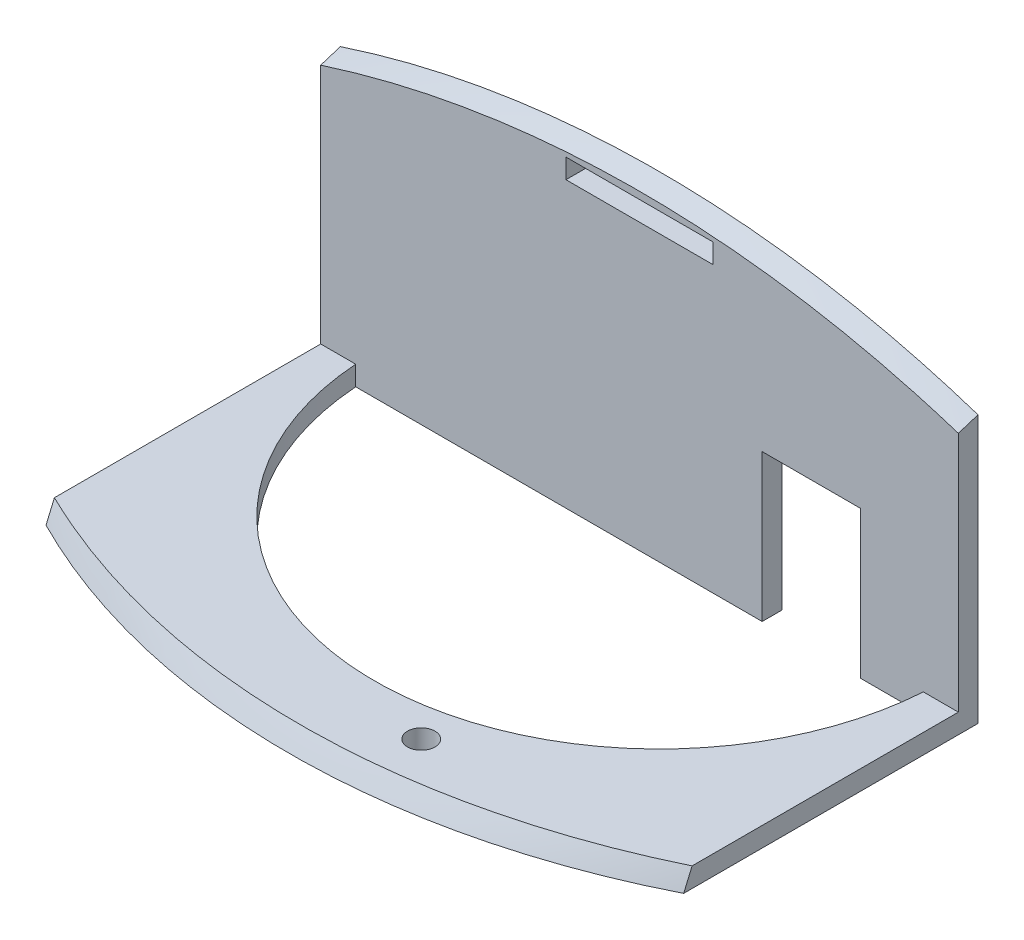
ISO-10303-21;
HEADER;
FILE_DESCRIPTION(('STEP AP214'),'2;1');
FILE_NAME('part.step','',(''),(''),'','','');
FILE_SCHEMA(('AUTOMOTIVE_DESIGN { 1 0 10303 214 1 1 1 1 }'));
ENDSEC;
DATA;
#1=APPLICATION_CONTEXT('core data for automotive mechanical design processes');
#2=APPLICATION_PROTOCOL_DEFINITION('international standard','automotive_design',2000,#1);
#3=PRODUCT_CONTEXT('',#1,'mechanical');
#4=PRODUCT('Part','Part','',(#3));
#5=PRODUCT_RELATED_PRODUCT_CATEGORY('part','',(#4));
#6=PRODUCT_DEFINITION_FORMATION('','',#4);
#7=PRODUCT_DEFINITION_CONTEXT('part definition',#1,'design');
#8=PRODUCT_DEFINITION('design','',#6,#7);
#9=PRODUCT_DEFINITION_SHAPE('','',#8);
#10=(LENGTH_UNIT() NAMED_UNIT(*) SI_UNIT(.MILLI.,.METRE.));
#11=(NAMED_UNIT(*) PLANE_ANGLE_UNIT() SI_UNIT($,.RADIAN.));
#12=(NAMED_UNIT(*) SI_UNIT($,.STERADIAN.) SOLID_ANGLE_UNIT());
#13=UNCERTAINTY_MEASURE_WITH_UNIT(LENGTH_MEASURE(1.E-05),#10,'distance_accuracy_value','');
#14=(GEOMETRIC_REPRESENTATION_CONTEXT(3) GLOBAL_UNCERTAINTY_ASSIGNED_CONTEXT((#13)) GLOBAL_UNIT_ASSIGNED_CONTEXT((#10,
#11,#12)) REPRESENTATION_CONTEXT('',''));
#15=CARTESIAN_POINT('',(0.,0.,0.));
#16=DIRECTION('',(0.,0.,1.));
#17=DIRECTION('',(1.,0.,0.));
#18=AXIS2_PLACEMENT_3D('',#15,#16,#17);
#19=CARTESIAN_POINT('',(32.5,0.,25.));
#20=DIRECTION('',(1.,0.,0.));
#21=DIRECTION('',(0.,0.,-1.));
#22=AXIS2_PLACEMENT_3D('',#19,#20,#21);
#23=PLANE('',#22);
#24=DIRECTION('',(0.,0.,1.));
#25=VECTOR('',#24,1.);
#26=CARTESIAN_POINT('',(32.5,2.,0.999999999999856));
#27=LINE('',#26,#25);
#28=CARTESIAN_POINT('',(32.5,2.,-23.));
#29=VERTEX_POINT('',#28);
#30=CARTESIAN_POINT('',(32.5,2.,4.14318462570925));
#31=VERTEX_POINT('',#30);
#32=EDGE_CURVE('E366',#29,#31,#27,.T.);
#33=ORIENTED_EDGE('',*,*,#32,.T.);
#34=CARTESIAN_POINT('',(32.5,2.,4.14318462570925));
#35=CARTESIAN_POINT('',(32.5,1.3401544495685,4.44437402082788));
#36=CARTESIAN_POINT('',(32.5,0.673243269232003,4.73008389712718));
#37=CARTESIAN_POINT('',(32.5,0.,4.99999999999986));
#38=(BOUNDED_CURVE() B_SPLINE_CURVE(3,(#34,#35,#36,#37),.UNSPECIFIED.,.F.,
.F.) B_SPLINE_CURVE_WITH_KNOTS((4,4),(-0.0518803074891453,0.),
.UNSPECIFIED.) CURVE() GEOMETRIC_REPRESENTATION_ITEM() RATIONAL_B_SPLINE_CURVE((1.,1.,1.,1.)) REPRESENTATION_ITEM(''));
#39=CARTESIAN_POINT('',(32.5,0.,4.99999999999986));
#40=VERTEX_POINT('',#39);
#41=EDGE_CURVE('E10',#31,#40,#38,.T.);
#42=ORIENTED_EDGE('',*,*,#41,.T.);
#43=DIRECTION('',(0.,0.,-1.));
#44=VECTOR('',#43,1.);
#45=CARTESIAN_POINT('',(32.5,0.,25.));
#46=LINE('',#45,#44);
#47=CARTESIAN_POINT('',(32.5,0.,-25.));
#48=VERTEX_POINT('',#47);
#49=EDGE_CURVE('E435',#40,#48,#46,.T.);
#50=ORIENTED_EDGE('',*,*,#49,.T.);
#51=DIRECTION('',(0.,1.,0.));
#52=VECTOR('',#51,1.);
#53=CARTESIAN_POINT('',(32.5,0.,-25.));
#54=LINE('',#53,#52);
#55=CARTESIAN_POINT('',(32.5,27.25,-25.));
#56=VERTEX_POINT('',#55);
#57=EDGE_CURVE('E190',#48,#56,#54,.T.);
#58=ORIENTED_EDGE('',*,*,#57,.T.);
#59=CARTESIAN_POINT('',(32.5,27.25,-25.));
#60=CARTESIAN_POINT('',(32.5,27.0530904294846,-24.328650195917));
#61=CARTESIAN_POINT('',(32.5,26.8409898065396,-23.6617560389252));
#62=CARTESIAN_POINT('',(32.5,26.6139151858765,-23.));
#63=(BOUNDED_CURVE() B_SPLINE_CURVE(3,(#59,#60,#61,#62),.UNSPECIFIED.,.F.,
.F.) B_SPLINE_CURVE_WITH_KNOTS((4,4),(-1.,-0.949958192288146),
.UNSPECIFIED.) CURVE() GEOMETRIC_REPRESENTATION_ITEM() RATIONAL_B_SPLINE_CURVE((1.,1.,1.,1.)) REPRESENTATION_ITEM(''));
#64=CARTESIAN_POINT('',(32.5,26.6139151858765,-23.));
#65=VERTEX_POINT('',#64);
#66=EDGE_CURVE('E29',#56,#65,#63,.T.);
#67=ORIENTED_EDGE('',*,*,#66,.T.);
#68=DIRECTION('',(0.,-1.,0.));
#69=VECTOR('',#68,1.);
#70=CARTESIAN_POINT('',(32.5,17.587856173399,-23.));
#71=LINE('',#70,#69);
#72=EDGE_CURVE('E397',#65,#29,#71,.T.);
#73=ORIENTED_EDGE('',*,*,#72,.T.);
#74=EDGE_LOOP('',(#33,#42,#50,#58,#67,#73));
#75=FACE_BOUND('',#74,.T.);
#76=ADVANCED_FACE('F15',(#75),#23,.T.);
#77=CARTESIAN_POINT('',(-32.5,0.,4.99999999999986));
#78=CARTESIAN_POINT('',(-32.5,0.673243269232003,4.73008389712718));
#79=CARTESIAN_POINT('',(-32.5,1.3401544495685,4.44437402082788));
#80=CARTESIAN_POINT('',(-32.5,2.,4.14318462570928));
#81=CARTESIAN_POINT('',(-26.7685755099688,0.,7.89825468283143));
#82=CARTESIAN_POINT('',(-26.7642978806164,0.707415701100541,7.57821779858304));
#83=CARTESIAN_POINT('',(-26.7600209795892,1.40849520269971,7.24239969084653));
#84=CARTESIAN_POINT('',(-26.7557426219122,2.10251729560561,6.89107696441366));
#85=CARTESIAN_POINT('',(-14.5275749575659,0.,12.1483336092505));
#86=CARTESIAN_POINT('',(-14.5220751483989,0.75623346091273,11.756695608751));
#87=CARTESIAN_POINT('',(-14.5165540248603,1.5062247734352,11.3489767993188));
#88=CARTESIAN_POINT('',(-14.5110215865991,2.2492385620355,10.9254972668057));
#89=CARTESIAN_POINT('',(8.10648972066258,0.,13.6757710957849));
#90=CARTESIAN_POINT('',(8.10312872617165,0.773319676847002,13.2590727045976));
#91=CARTESIAN_POINT('',(8.09974602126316,1.54047160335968,12.8260560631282));
#92=CARTESIAN_POINT('',(8.09635943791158,2.30068829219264,12.3771431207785));
#93=CARTESIAN_POINT('',(23.9028632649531,0.,9.3473820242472));
#94=CARTESIAN_POINT('',(23.8964468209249,0.724501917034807,9.00228474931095));
#95=CARTESIAN_POINT('',(23.8900420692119,1.44265722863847,8.64143929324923));
#96=CARTESIAN_POINT('',(23.8836139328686,2.15377594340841,8.26502313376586));
#97=CARTESIAN_POINT('',(32.5,0.,4.99999999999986));
#98=CARTESIAN_POINT('',(32.5,0.673243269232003,4.73008389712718));
#99=CARTESIAN_POINT('',(32.5,1.3401544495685,4.44437402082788));
#100=CARTESIAN_POINT('',(32.5,2.,4.14318462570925));
#101=(BOUNDED_SURFACE() B_SPLINE_SURFACE(3,3,((#77,#78,#79,#80),(#81,#82,#83,#84),(#85,#86,#87,
#88),(#89,#90,#91,#92),(#93,#94,#95,#96),(#97,#98,#99,#100)),.UNSPECIFIED.,.F.,.F.,
.F.) B_SPLINE_SURFACE_WITH_KNOTS((4,1,1,4),(4,4),(0.,0.285714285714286,0.571428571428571,1.),
(0.,0.0518803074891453),
.UNSPECIFIED.) GEOMETRIC_REPRESENTATION_ITEM() RATIONAL_B_SPLINE_SURFACE(((1.,1.,1.,1.),(1.,1.,
1.,1.),(1.,1.,1.,1.),(1.,1.,1.,1.),(1.,1.,1.,1.),(1.,1.,1.,1.))) REPRESENTATION_ITEM('') SURFACE());
#102=CARTESIAN_POINT('',(32.5,2.,4.14318462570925));
#103=CARTESIAN_POINT('',(31.3821770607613,1.99999276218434,4.68703734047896));
#104=CARTESIAN_POINT('',(30.2507061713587,1.99991978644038,5.20281299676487));
#105=CARTESIAN_POINT('',(27.9210890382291,1.99972160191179,6.19522493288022));
#106=CARTESIAN_POINT('',(26.7220247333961,1.99959456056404,6.66970721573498));
#107=CARTESIAN_POINT('',(24.2579070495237,1.99937675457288,7.5718377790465));
#108=CARTESIAN_POINT('',(22.9920235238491,1.99928744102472,7.99721985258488));
#109=CARTESIAN_POINT('',(20.3956616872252,1.99919560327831,8.79306237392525));
#110=CARTESIAN_POINT('',(19.06445516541,1.99919615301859,9.16114580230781));
#111=CARTESIAN_POINT('',(16.339441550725,1.999302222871,9.83391129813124));
#112=CARTESIAN_POINT('',(14.9450166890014,1.99941119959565,10.1361059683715));
#113=CARTESIAN_POINT('',(12.825549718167,1.99962995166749,10.532007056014));
#114=CARTESIAN_POINT('',(12.105944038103,1.99971338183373,10.6554872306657));
#115=CARTESIAN_POINT('',(10.6522076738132,1.99989041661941,10.882888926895));
#116=CARTESIAN_POINT('',(9.91802459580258,1.99998415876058,10.9864780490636));
#117=CARTESIAN_POINT('',(8.43567504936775,2.00016977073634,11.172905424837));
#118=CARTESIAN_POINT('',(7.68746589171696,2.00026159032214,11.2554036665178));
#119=CARTESIAN_POINT('',(6.1776271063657,2.00042655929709,11.3984350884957));
#120=CARTESIAN_POINT('',(5.41596445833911,2.00049940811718,11.4586203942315));
#121=CARTESIAN_POINT('',(3.87986241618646,2.00060711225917,11.55579873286));
#122=CARTESIAN_POINT('',(3.10540051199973,2.00064139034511,11.5924359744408));
#123=CARTESIAN_POINT('',(1.54443652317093,2.00064158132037,11.6415575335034));
#124=CARTESIAN_POINT('',(0.757923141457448,2.00060649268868,11.6536828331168));
#125=CARTESIAN_POINT('',(-0.805741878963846,2.00046057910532,11.6528007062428));
#126=CARTESIAN_POINT('',(-1.58289370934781,2.00035065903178,11.6400902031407));
#127=CARTESIAN_POINT('',(-3.12629964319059,2.00010388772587,11.5905084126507));
#128=CARTESIAN_POINT('',(-3.89256393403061,1.99996740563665,11.5539537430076));
#129=CARTESIAN_POINT('',(-5.41345426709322,1.99968474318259,11.4577039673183));
#130=CARTESIAN_POINT('',(-6.16810010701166,1.99953871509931,11.3983215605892));
#131=CARTESIAN_POINT('',(-7.66507103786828,1.99925632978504,11.2574225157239));
#132=CARTESIAN_POINT('',(-8.40742522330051,1.99911986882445,11.1762146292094));
#133=CARTESIAN_POINT('',(-9.87919870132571,1.99886970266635,10.9926541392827));
#134=CARTESIAN_POINT('',(-10.6086559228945,1.99875571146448,10.8906062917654));
#135=CARTESIAN_POINT('',(-12.0540422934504,1.99855963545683,10.6663630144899));
#136=CARTESIAN_POINT('',(-12.7700183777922,1.99847712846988,10.5444679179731));
#137=CARTESIAN_POINT('',(-14.8817247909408,1.99828764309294,10.1527689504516));
#138=CARTESIAN_POINT('',(-16.2720385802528,1.99823285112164,9.85308051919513));
#139=CARTESIAN_POINT('',(-18.9930267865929,1.99828013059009,9.18418783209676));
#140=CARTESIAN_POINT('',(-20.3242618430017,1.99837770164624,8.81725011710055));
#141=CARTESIAN_POINT('',(-22.924817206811,1.99868101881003,8.02217853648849));
#142=CARTESIAN_POINT('',(-24.194797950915,1.99888343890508,7.59620565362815));
#143=CARTESIAN_POINT('',(-26.6710899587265,1.99931092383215,6.69096875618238));
#144=CARTESIAN_POINT('',(-27.8781548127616,1.99953509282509,6.21376460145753));
#145=CARTESIAN_POINT('',(-30.2275376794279,1.99987354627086,5.21361273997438));
#146=CARTESIAN_POINT('',(-31.3706903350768,1.99999112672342,4.69262487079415));
#147=CARTESIAN_POINT('',(-32.5,2.,4.14318462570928));
#148=B_SPLINE_CURVE_WITH_KNOTS('',3,(#102,#103,#104,#105,#106,#107,#108,#109,#110,#111,#112,
#113,#114,#115,#116,#117,#118,#119,#120,#121,#122,#123,#124,#125,#126,#127,#128,#129,#130,#131,
#132,#133,#134,#135,#136,#137,#138,#139,#140,#141,#142,#143,#144,#145,#146,#147),.UNSPECIFIED.,
.F.,.F.,(4,2,2,2,2,2,2,2,2,2,2,2,2,2,2,2,2,2,2,2,2,2,4),(0.,3.72890680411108,7.59577077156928,
11.6001788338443,15.7415927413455,20.0194044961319,22.2095123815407,24.4335270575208,
26.6914086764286,28.9831434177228,31.3087373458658,33.668153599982,35.9995344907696,
38.3005713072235,40.5711507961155,42.8111619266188,45.0205010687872,47.199076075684,
51.4632265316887,55.6037880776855,59.6203888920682,63.5125519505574,67.2797891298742),.UNSPECIFIED.);
#149=CARTESIAN_POINT('',(-32.5,1.99999999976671,4.14318462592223));
#150=VERTEX_POINT('',#149);
#151=EDGE_CURVE('E353',#31,#150,#148,.T.);
#152=CARTESIAN_POINT('',(-32.5,0.,4.99999999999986));
#153=CARTESIAN_POINT('',(-32.5,0.673243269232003,4.73008389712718));
#154=CARTESIAN_POINT('',(-32.5,1.3401544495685,4.44437402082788));
#155=CARTESIAN_POINT('',(-32.5,2.,4.14318462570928));
#156=(BOUNDED_CURVE() B_SPLINE_CURVE(3,(#152,#153,#154,#155),.UNSPECIFIED.,.F.,
.F.) B_SPLINE_CURVE_WITH_KNOTS((4,4),(0.,0.0518803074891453),
.UNSPECIFIED.) CURVE() GEOMETRIC_REPRESENTATION_ITEM() RATIONAL_B_SPLINE_CURVE((1.,1.,1.,1.)) REPRESENTATION_ITEM(''));
#157=CARTESIAN_POINT('',(-32.5,0.,4.99999999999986));
#158=VERTEX_POINT('',#157);
#159=EDGE_CURVE('E375',#158,#150,#156,.T.);
#160=CARTESIAN_POINT('',(32.5,0.,4.99999999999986));
#161=CARTESIAN_POINT('',(23.9028632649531,0.,9.3473820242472));
#162=CARTESIAN_POINT('',(8.10648972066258,0.,13.6757710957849));
#163=CARTESIAN_POINT('',(-14.5275749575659,0.,12.1483336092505));
#164=CARTESIAN_POINT('',(-26.7685755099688,0.,7.89825468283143));
#165=CARTESIAN_POINT('',(-32.5,0.,4.99999999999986));
#166=(BOUNDED_CURVE() B_SPLINE_CURVE(3,(#160,#161,#162,#163,#164,#165),.UNSPECIFIED.,.F.,
.F.) B_SPLINE_CURVE_WITH_KNOTS((4,1,1,4),(-1.,-0.571428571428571,-0.285714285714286,0.),
.UNSPECIFIED.) CURVE() GEOMETRIC_REPRESENTATION_ITEM() RATIONAL_B_SPLINE_CURVE((1.,1.,1.,1.,1.,1.)) REPRESENTATION_ITEM(''));
#167=EDGE_CURVE('E394',#40,#158,#166,.T.);
#168=ORIENTED_EDGE('',*,*,#151,.T.);
#169=ORIENTED_EDGE('',*,*,#159,.F.);
#170=ORIENTED_EDGE('',*,*,#167,.F.);
#171=ORIENTED_EDGE('',*,*,#41,.F.);
#172=EDGE_LOOP('',(#168,#169,#170,#171));
#173=FACE_BOUND('',#172,.T.);
#174=ADVANCED_FACE('F323',(#173),#101,.T.);
#175=CARTESIAN_POINT('',(-32.5,26.6139151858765,-23.));
#176=CARTESIAN_POINT('',(-32.5,26.8409898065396,-23.6617560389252));
#177=CARTESIAN_POINT('',(-32.5,27.0530904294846,-24.328650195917));
#178=CARTESIAN_POINT('',(-32.5,27.25,-25.));
#179=CARTESIAN_POINT('',(-20.5671959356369,30.3682161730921,-22.7099321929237));
#180=CARTESIAN_POINT('',(-20.5589185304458,30.6612554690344,-23.4685100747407));
#181=CARTESIAN_POINT('',(-20.5506917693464,30.9392372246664,-24.2319609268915));
#182=CARTESIAN_POINT('',(-20.5424396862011,31.2020696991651,-25.));
#183=CARTESIAN_POINT('',(1.65970779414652,33.2738870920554,-22.4902805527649));
#184=CARTESIAN_POINT('',(1.65763986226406,33.6167364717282,-23.3225516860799));
#185=CARTESIAN_POINT('',(1.65558040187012,33.9444504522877,-24.1594439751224));
#186=CARTESIAN_POINT('',(1.6535173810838,34.2567251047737,-25.));
#187=CARTESIAN_POINT('',(23.5503969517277,29.4296409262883,-22.7824491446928));
#188=CARTESIAN_POINT('',(23.5441867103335,29.7061583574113,-23.5167233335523));
#189=CARTESIAN_POINT('',(23.5380188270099,29.967700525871,-24.2561332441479));
#190=CARTESIAN_POINT('',(23.531829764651,30.2140522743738,-25.));
#191=CARTESIAN_POINT('',(32.5,26.6139151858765,-23.));
#192=CARTESIAN_POINT('',(32.5,26.8409898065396,-23.6617560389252));
#193=CARTESIAN_POINT('',(32.5,27.0530904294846,-24.328650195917));
#194=CARTESIAN_POINT('',(32.5,27.25,-25.));
#195=(BOUNDED_SURFACE() B_SPLINE_SURFACE(3,3,((#175,#176,#177,#178),(#179,#180,#181,#182),(#183,
#184,#185,#186),(#187,#188,#189,#190),(#191,#192,#193,#194)),.UNSPECIFIED.,.F.,.F.,
.F.) B_SPLINE_SURFACE_WITH_KNOTS((4,1,4),(4,4),(0.,0.571428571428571,1.),(0.949958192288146,1.),
.UNSPECIFIED.) GEOMETRIC_REPRESENTATION_ITEM() RATIONAL_B_SPLINE_SURFACE(((1.,1.,1.,1.),(1.,1.,
1.,1.),(1.,1.,1.,1.),(1.,1.,1.,1.),(1.,1.,1.,1.))) REPRESENTATION_ITEM('') SURFACE());
#196=CARTESIAN_POINT('',(-32.5,26.6139151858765,-23.));
#197=CARTESIAN_POINT('',(-31.370216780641,26.9787964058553,-23.0000143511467));
#198=CARTESIAN_POINT('',(-30.2342610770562,27.3245606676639,-23.000215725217));
#199=CARTESIAN_POINT('',(-27.8990585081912,27.9925354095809,-23.0008108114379));
#200=CARTESIAN_POINT('',(-26.6992954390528,28.3129422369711,-23.0012129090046));
#201=CARTESIAN_POINT('',(-24.2366077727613,28.9243980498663,-23.0020067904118));
#202=CARTESIAN_POINT('',(-22.9732129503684,29.2135539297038,-23.0023973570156));
#203=CARTESIAN_POINT('',(-20.3837484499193,29.7564401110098,-23.0030241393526));
#204=CARTESIAN_POINT('',(-19.057263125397,30.008188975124,-23.0032532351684));
#205=CARTESIAN_POINT('',(-16.3425081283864,30.4699274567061,-23.0034645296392));
#206=CARTESIAN_POINT('',(-14.9538863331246,30.6778482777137,-23.0034365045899));
#207=CARTESIAN_POINT('',(-12.1162017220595,31.0453404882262,-23.0031183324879));
#208=CARTESIAN_POINT('',(-10.6668595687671,31.202757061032,-23.0028181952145));
#209=CARTESIAN_POINT('',(-7.70958334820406,31.4624060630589,-23.0020493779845));
#210=CARTESIAN_POINT('',(-6.2014523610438,31.5623993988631,-23.0015749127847));
#211=CARTESIAN_POINT('',(-3.12900986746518,31.7001151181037,-23.0006398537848));
#212=CARTESIAN_POINT('',(-1.56459391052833,31.73551548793,-23.000180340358));
#213=CARTESIAN_POINT('',(1.57889992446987,31.7367677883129,-22.9997523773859));
#214=CARTESIAN_POINT('',(3.15797817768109,31.7019665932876,-22.9997885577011));
#215=CARTESIAN_POINT('',(6.25547089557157,31.5635485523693,-23.0001263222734));
#216=CARTESIAN_POINT('',(7.77399983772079,31.4624846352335,-23.0004181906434));
#217=CARTESIAN_POINT('',(10.7477698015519,31.1996693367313,-23.0009715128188));
#218=CARTESIAN_POINT('',(12.2032275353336,31.0403640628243,-23.0012337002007));
#219=CARTESIAN_POINT('',(15.0488718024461,30.6688721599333,-23.0016008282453));
#220=CARTESIAN_POINT('',(16.4393641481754,30.459024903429,-23.0017115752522));
#221=CARTESIAN_POINT('',(19.1536623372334,29.993913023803,-23.0017429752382));
#222=CARTESIAN_POINT('',(20.4778511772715,29.7408812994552,-23.001671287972));
#223=CARTESIAN_POINT('',(23.0586357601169,29.1965227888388,-23.0013885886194));
#224=CARTESIAN_POINT('',(24.3156803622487,28.907322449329,-23.0011837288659));
#225=CARTESIAN_POINT('',(26.7617199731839,28.2974008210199,-23.0007370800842));
#226=CARTESIAN_POINT('',(27.9512190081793,27.9786997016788,-23.0004973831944));
#227=CARTESIAN_POINT('',(30.2621085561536,27.3162063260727,-23.0001365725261));
#228=CARTESIAN_POINT('',(31.3840480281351,26.9743279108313,-23.0000103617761));
#229=CARTESIAN_POINT('',(32.5,26.6139151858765,-23.));
#230=B_SPLINE_CURVE_WITH_KNOTS('',3,(#196,#197,#198,#199,#200,#201,#202,#203,#204,#205,#206,
#207,#208,#209,#210,#211,#212,#213,#214,#215,#216,#217,#218,#219,#220,#221,#222,#223,#224,#225,
#226,#227,#228,#229),.UNSPECIFIED.,.F.,.F.,(4,2,2,2,2,2,2,2,2,2,2,2,2,2,2,2,4),(0.,
3.56156413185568,7.28622214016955,11.1735366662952,15.2230423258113,19.4342421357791,
23.8066022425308,28.3395467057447,33.0324549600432,37.7692253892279,42.3334493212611,
46.7246301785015,50.9422250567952,54.9856852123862,58.8544758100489,62.5480902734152,
66.0660618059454),.UNSPECIFIED.);
#231=CARTESIAN_POINT('',(-32.5,26.6139151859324,-23.0000000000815));
#232=VERTEX_POINT('',#231);
#233=EDGE_CURVE('E272',#232,#65,#230,.T.);
#234=CARTESIAN_POINT('',(-32.5,27.25,-25.));
#235=CARTESIAN_POINT('',(-20.5424396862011,31.2020696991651,-25.));
#236=CARTESIAN_POINT('',(1.6535173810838,34.2567251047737,-25.));
#237=CARTESIAN_POINT('',(23.531829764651,30.2140522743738,-25.));
#238=CARTESIAN_POINT('',(32.5,27.25,-25.));
#239=(BOUNDED_CURVE() B_SPLINE_CURVE(3,(#234,#235,#236,#237,#238),.UNSPECIFIED.,.F.,
.F.) B_SPLINE_CURVE_WITH_KNOTS((4,1,4),(0.,0.571428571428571,1.),
.UNSPECIFIED.) CURVE() GEOMETRIC_REPRESENTATION_ITEM() RATIONAL_B_SPLINE_CURVE((1.,1.,1.,1.,1.)) REPRESENTATION_ITEM(''));
#240=CARTESIAN_POINT('',(-32.5,27.25,-25.));
#241=VERTEX_POINT('',#240);
#242=EDGE_CURVE('E197',#241,#56,#239,.T.);
#243=CARTESIAN_POINT('',(-32.5,26.6139151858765,-23.));
#244=CARTESIAN_POINT('',(-32.5,26.8409898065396,-23.6617560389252));
#245=CARTESIAN_POINT('',(-32.5,27.0530904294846,-24.328650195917));
#246=CARTESIAN_POINT('',(-32.5,27.25,-25.));
#247=(BOUNDED_CURVE() B_SPLINE_CURVE(3,(#243,#244,#245,#246),.UNSPECIFIED.,.F.,
.F.) B_SPLINE_CURVE_WITH_KNOTS((4,4),(0.949958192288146,1.),
.UNSPECIFIED.) CURVE() GEOMETRIC_REPRESENTATION_ITEM() RATIONAL_B_SPLINE_CURVE((1.,1.,1.,1.)) REPRESENTATION_ITEM(''));
#248=EDGE_CURVE('E43',#232,#241,#247,.T.);
#249=ORIENTED_EDGE('',*,*,#233,.T.);
#250=ORIENTED_EDGE('',*,*,#66,.F.);
#251=ORIENTED_EDGE('',*,*,#242,.F.);
#252=ORIENTED_EDGE('',*,*,#248,.F.);
#253=EDGE_LOOP('',(#249,#250,#251,#252));
#254=FACE_BOUND('',#253,.T.);
#255=ADVANCED_FACE('F17',(#254),#195,.T.);
#256=CARTESIAN_POINT('',(-32.5,0.,-25.));
#257=DIRECTION('',(-1.,0.,0.));
#258=DIRECTION('',(0.,1.,0.));
#259=AXIS2_PLACEMENT_3D('',#256,#257,#258);
#260=PLANE('',#259);
#261=DIRECTION('',(0.,0.,-1.));
#262=VECTOR('',#261,1.);
#263=CARTESIAN_POINT('',(-32.5,2.,-24.));
#264=LINE('',#263,#262);
#265=CARTESIAN_POINT('',(-32.5,2.,-23.));
#266=VERTEX_POINT('',#265);
#267=EDGE_CURVE('E171',#150,#266,#264,.T.);
#268=ORIENTED_EDGE('',*,*,#267,.T.);
#269=DIRECTION('',(0.,1.,0.));
#270=VECTOR('',#269,1.);
#271=CARTESIAN_POINT('',(-32.5,17.587856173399,-23.));
#272=LINE('',#271,#270);
#273=EDGE_CURVE('E166',#266,#232,#272,.T.);
#274=ORIENTED_EDGE('',*,*,#273,.T.);
#275=ORIENTED_EDGE('',*,*,#248,.T.);
#276=DIRECTION('',(0.,1.,0.));
#277=VECTOR('',#276,1.);
#278=CARTESIAN_POINT('',(-32.5,0.,-25.));
#279=LINE('',#278,#277);
#280=CARTESIAN_POINT('',(-32.5,0.,-25.));
#281=VERTEX_POINT('',#280);
#282=EDGE_CURVE('E250',#281,#241,#279,.T.);
#283=ORIENTED_EDGE('',*,*,#282,.F.);
#284=DIRECTION('',(0.,0.,1.));
#285=VECTOR('',#284,1.);
#286=CARTESIAN_POINT('',(-32.5,0.,-25.));
#287=LINE('',#286,#285);
#288=EDGE_CURVE('E263',#281,#158,#287,.T.);
#289=ORIENTED_EDGE('',*,*,#288,.T.);
#290=ORIENTED_EDGE('',*,*,#159,.T.);
#291=EDGE_LOOP('',(#268,#274,#275,#283,#289,#290));
#292=FACE_BOUND('',#291,.T.);
#293=ADVANCED_FACE('F297',(#292),#260,.T.);
#294=CARTESIAN_POINT('',(32.5,35.1757123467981,-23.));
#295=DIRECTION('',(0.,0.,-1.));
#296=DIRECTION('',(-1.,0.,0.));
#297=AXIS2_PLACEMENT_3D('',#294,#295,#296);
#298=PLANE('',#297);
#299=DIRECTION('',(0.,-1.,0.));
#300=VECTOR('',#299,1.);
#301=CARTESIAN_POINT('',(7.5,33.0878561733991,-23.));
#302=LINE('',#301,#300);
#303=CARTESIAN_POINT('',(7.5,31.,-23.));
#304=VERTEX_POINT('',#303);
#305=CARTESIAN_POINT('',(7.5,29.,-23.));
#306=VERTEX_POINT('',#305);
#307=EDGE_CURVE('E209',#304,#306,#302,.T.);
#308=ORIENTED_EDGE('',*,*,#307,.T.);
#309=DIRECTION('',(-1.,0.,0.));
#310=VECTOR('',#309,1.);
#311=CARTESIAN_POINT('',(20.,29.,-23.));
#312=LINE('',#311,#310);
#313=CARTESIAN_POINT('',(-7.49999999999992,29.,-23.));
#314=VERTEX_POINT('',#313);
#315=EDGE_CURVE('E481',#306,#314,#312,.T.);
#316=ORIENTED_EDGE('',*,*,#315,.T.);
#317=DIRECTION('',(0.,1.,0.));
#318=VECTOR('',#317,1.);
#319=CARTESIAN_POINT('',(-7.49999999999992,32.0878561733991,-23.));
#320=LINE('',#319,#318);
#321=CARTESIAN_POINT('',(-7.49999999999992,31.,-23.));
#322=VERTEX_POINT('',#321);
#323=EDGE_CURVE('E207',#314,#322,#320,.T.);
#324=ORIENTED_EDGE('',*,*,#323,.T.);
#325=DIRECTION('',(1.,0.,0.));
#326=VECTOR('',#325,1.);
#327=CARTESIAN_POINT('',(12.5,31.,-23.));
#328=LINE('',#327,#326);
#329=EDGE_CURVE('E218',#322,#304,#328,.T.);
#330=ORIENTED_EDGE('',*,*,#329,.T.);
#331=EDGE_LOOP('',(#308,#316,#324,#330));
#332=FACE_BOUND('',#331,.T.);
#333=DIRECTION('',(0.,-1.,0.));
#334=VECTOR('',#333,1.);
#335=CARTESIAN_POINT('',(22.5,25.0878561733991,-23.));
#336=LINE('',#335,#334);
#337=CARTESIAN_POINT('',(22.5,15.,-23.));
#338=VERTEX_POINT('',#337);
#339=CARTESIAN_POINT('',(22.5,0.,-23.));
#340=VERTEX_POINT('',#339);
#341=EDGE_CURVE('E232',#338,#340,#336,.T.);
#342=ORIENTED_EDGE('',*,*,#341,.T.);
#343=DIRECTION('',(-1.,0.,0.));
#344=VECTOR('',#343,1.);
#345=CARTESIAN_POINT('',(-14.4654761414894,0.,-23.));
#346=LINE('',#345,#344);
#347=CARTESIAN_POINT('',(28.930952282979,0.,-23.));
#348=VERTEX_POINT('',#347);
#349=EDGE_CURVE('E247',#348,#340,#346,.T.);
#350=ORIENTED_EDGE('',*,*,#349,.F.);
#351=DIRECTION('',(0.,-1.,0.));
#352=VECTOR('',#351,1.);
#353=CARTESIAN_POINT('',(28.930952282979,2.,-23.));
#354=LINE('',#353,#352);
#355=CARTESIAN_POINT('',(28.930952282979,2.,-23.));
#356=VERTEX_POINT('',#355);
#357=EDGE_CURVE('E172',#356,#348,#354,.T.);
#358=ORIENTED_EDGE('',*,*,#357,.F.);
#359=DIRECTION('',(-1.,0.,0.));
#360=VECTOR('',#359,1.);
#361=CARTESIAN_POINT('',(32.5,2.,-23.));
#362=LINE('',#361,#360);
#363=EDGE_CURVE('E179',#29,#356,#362,.T.);
#364=ORIENTED_EDGE('',*,*,#363,.F.);
#365=ORIENTED_EDGE('',*,*,#72,.F.);
#366=ORIENTED_EDGE('',*,*,#233,.F.);
#367=ORIENTED_EDGE('',*,*,#273,.F.);
#368=DIRECTION('',(-1.,0.,0.));
#369=VECTOR('',#368,1.);
#370=CARTESIAN_POINT('',(32.5,2.,-23.));
#371=LINE('',#370,#369);
#372=CARTESIAN_POINT('',(-28.9309522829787,2.,-23.));
#373=VERTEX_POINT('',#372);
#374=EDGE_CURVE('E157',#373,#266,#371,.T.);
#375=ORIENTED_EDGE('',*,*,#374,.F.);
#376=DIRECTION('',(0.,-1.,0.));
#377=VECTOR('',#376,1.);
#378=CARTESIAN_POINT('',(-28.9309522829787,2.,-23.));
#379=LINE('',#378,#377);
#380=CARTESIAN_POINT('',(-28.9309522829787,0.,-23.));
#381=VERTEX_POINT('',#380);
#382=EDGE_CURVE('E163',#373,#381,#379,.T.);
#383=ORIENTED_EDGE('',*,*,#382,.T.);
#384=DIRECTION('',(-1.,0.,0.));
#385=VECTOR('',#384,1.);
#386=CARTESIAN_POINT('',(-14.4654761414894,0.,-23.));
#387=LINE('',#386,#385);
#388=CARTESIAN_POINT('',(12.5,0.,-23.));
#389=VERTEX_POINT('',#388);
#390=EDGE_CURVE('E201',#389,#381,#387,.T.);
#391=ORIENTED_EDGE('',*,*,#390,.F.);
#392=DIRECTION('',(0.,1.,0.));
#393=VECTOR('',#392,1.);
#394=CARTESIAN_POINT('',(12.5,17.587856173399,-23.));
#395=LINE('',#394,#393);
#396=CARTESIAN_POINT('',(12.5,15.,-23.));
#397=VERTEX_POINT('',#396);
#398=EDGE_CURVE('E238',#389,#397,#395,.T.);
#399=ORIENTED_EDGE('',*,*,#398,.T.);
#400=DIRECTION('',(1.,0.,0.));
#401=VECTOR('',#400,1.);
#402=CARTESIAN_POINT('',(22.5,15.,-23.));
#403=LINE('',#402,#401);
#404=EDGE_CURVE('E436',#397,#338,#403,.T.);
#405=ORIENTED_EDGE('',*,*,#404,.T.);
#406=EDGE_LOOP('',(#342,#350,#358,#364,#365,#366,#367,#375,#383,#391,#399,#405));
#407=FACE_BOUND('',#406,.T.);
#408=ADVANCED_FACE('F160',(#332,#407),#298,.F.);
#409=CARTESIAN_POINT('',(32.5,2.,-23.));
#410=DIRECTION('',(0.,-1.,0.));
#411=DIRECTION('',(0.,0.,-1.));
#412=AXIS2_PLACEMENT_3D('',#409,#410,#411);
#413=PLANE('',#412);
#414=CARTESIAN_POINT('',(7.5,2.,6.74999999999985));
#415=DIRECTION('',(0.,-1.,0.));
#416=DIRECTION('',(1.,0.,0.));
#417=AXIS2_PLACEMENT_3D('',#414,#415,#416);
#418=CIRCLE('',#417,1.4);
#419=CARTESIAN_POINT('',(8.9,2.,6.74999999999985));
#420=VERTEX_POINT('',#419);
#421=CARTESIAN_POINT('',(6.10000000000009,2.,6.74999999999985));
#422=VERTEX_POINT('',#421);
#423=EDGE_CURVE('E227',#420,#422,#418,.T.);
#424=ORIENTED_EDGE('',*,*,#423,.T.);
#425=CARTESIAN_POINT('',(7.5,2.,6.74999999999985));
#426=DIRECTION('',(0.,-1.,0.));
#427=DIRECTION('',(1.,0.,0.));
#428=AXIS2_PLACEMENT_3D('',#425,#426,#427);
#429=CIRCLE('',#428,1.4);
#430=EDGE_CURVE('E223',#422,#420,#429,.T.);
#431=ORIENTED_EDGE('',*,*,#430,.T.);
#432=EDGE_LOOP('',(#424,#431));
#433=FACE_BOUND('',#432,.T.);
#434=CARTESIAN_POINT('',(0.,2.,-25.));
#435=DIRECTION('',(0.,-1.,0.));
#436=DIRECTION('',(1.,0.,0.));
#437=AXIS2_PLACEMENT_3D('',#434,#435,#436);
#438=CIRCLE('',#437,29.);
#439=EDGE_CURVE('E175',#356,#373,#438,.T.);
#440=ORIENTED_EDGE('',*,*,#439,.T.);
#441=ORIENTED_EDGE('',*,*,#374,.T.);
#442=ORIENTED_EDGE('',*,*,#267,.F.);
#443=ORIENTED_EDGE('',*,*,#151,.F.);
#444=ORIENTED_EDGE('',*,*,#32,.F.);
#445=ORIENTED_EDGE('',*,*,#363,.T.);
#446=EDGE_LOOP('',(#440,#441,#442,#443,#444,#445));
#447=FACE_BOUND('',#446,.T.);
#448=ADVANCED_FACE('F176',(#433,#447),#413,.F.);
#449=CARTESIAN_POINT('',(0.,2.,-25.));
#450=DIRECTION('',(0.,-1.,0.));
#451=DIRECTION('',(1.,0.,0.));
#452=AXIS2_PLACEMENT_3D('',#449,#450,#451);
#453=CYLINDRICAL_SURFACE('',#452,29.);
#454=CARTESIAN_POINT('',(0.,0.,-25.));
#455=DIRECTION('',(0.,1.,0.));
#456=DIRECTION('',(1.,0.,0.));
#457=AXIS2_PLACEMENT_3D('',#454,#455,#456);
#458=CIRCLE('',#457,29.);
#459=EDGE_CURVE('E187',#381,#348,#458,.T.);
#460=ORIENTED_EDGE('',*,*,#459,.F.);
#461=ORIENTED_EDGE('',*,*,#382,.F.);
#462=ORIENTED_EDGE('',*,*,#439,.F.);
#463=ORIENTED_EDGE('',*,*,#357,.T.);
#464=EDGE_LOOP('',(#460,#461,#462,#463));
#465=FACE_BOUND('',#464,.T.);
#466=ADVANCED_FACE('F185',(#465),#453,.F.);
#467=CARTESIAN_POINT('',(32.5,0.,-25.));
#468=DIRECTION('',(0.,0.,-1.));
#469=DIRECTION('',(0.,-1.,0.));
#470=AXIS2_PLACEMENT_3D('',#467,#468,#469);
#471=PLANE('',#470);
#472=DIRECTION('',(0.,1.,0.));
#473=VECTOR('',#472,1.);
#474=CARTESIAN_POINT('',(7.5,15.5,-25.));
#475=LINE('',#474,#473);
#476=CARTESIAN_POINT('',(7.5,29.,-25.));
#477=VERTEX_POINT('',#476);
#478=CARTESIAN_POINT('',(7.5,31.,-25.));
#479=VERTEX_POINT('',#478);
#480=EDGE_CURVE('E214',#477,#479,#475,.T.);
#481=ORIENTED_EDGE('',*,*,#480,.T.);
#482=DIRECTION('',(-1.,0.,0.));
#483=VECTOR('',#482,1.);
#484=CARTESIAN_POINT('',(12.5,31.,-25.));
#485=LINE('',#484,#483);
#486=CARTESIAN_POINT('',(-7.49999999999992,31.,-25.));
#487=VERTEX_POINT('',#486);
#488=EDGE_CURVE('E215',#479,#487,#485,.T.);
#489=ORIENTED_EDGE('',*,*,#488,.T.);
#490=DIRECTION('',(0.,-1.,0.));
#491=VECTOR('',#490,1.);
#492=CARTESIAN_POINT('',(-7.49999999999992,14.5,-25.));
#493=LINE('',#492,#491);
#494=CARTESIAN_POINT('',(-7.49999999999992,29.,-25.));
#495=VERTEX_POINT('',#494);
#496=EDGE_CURVE('E208',#487,#495,#493,.T.);
#497=ORIENTED_EDGE('',*,*,#496,.T.);
#498=DIRECTION('',(1.,0.,0.));
#499=VECTOR('',#498,1.);
#500=CARTESIAN_POINT('',(20.,29.,-25.));
#501=LINE('',#500,#499);
#502=EDGE_CURVE('E246',#495,#477,#501,.T.);
#503=ORIENTED_EDGE('',*,*,#502,.T.);
#504=EDGE_LOOP('',(#481,#489,#497,#503));
#505=FACE_BOUND('',#504,.T.);
#506=DIRECTION('',(0.,1.,0.));
#507=VECTOR('',#506,1.);
#508=CARTESIAN_POINT('',(22.5,7.5,-25.));
#509=LINE('',#508,#507);
#510=CARTESIAN_POINT('',(22.5,0.,-25.));
#511=VERTEX_POINT('',#510);
#512=CARTESIAN_POINT('',(22.5,15.,-25.));
#513=VERTEX_POINT('',#512);
#514=EDGE_CURVE('E233',#511,#513,#509,.T.);
#515=ORIENTED_EDGE('',*,*,#514,.T.);
#516=DIRECTION('',(-1.,0.,0.));
#517=VECTOR('',#516,1.);
#518=CARTESIAN_POINT('',(22.5,15.,-25.));
#519=LINE('',#518,#517);
#520=CARTESIAN_POINT('',(12.5,15.,-25.));
#521=VERTEX_POINT('',#520);
#522=EDGE_CURVE('E440',#513,#521,#519,.T.);
#523=ORIENTED_EDGE('',*,*,#522,.T.);
#524=DIRECTION('',(0.,-1.,0.));
#525=VECTOR('',#524,1.);
#526=CARTESIAN_POINT('',(12.5,0.,-25.));
#527=LINE('',#526,#525);
#528=CARTESIAN_POINT('',(12.5,0.,-25.));
#529=VERTEX_POINT('',#528);
#530=EDGE_CURVE('E409',#521,#529,#527,.T.);
#531=ORIENTED_EDGE('',*,*,#530,.T.);
#532=DIRECTION('',(-1.,0.,0.));
#533=VECTOR('',#532,1.);
#534=CARTESIAN_POINT('',(32.5,0.,-25.));
#535=LINE('',#534,#533);
#536=EDGE_CURVE('E256',#529,#281,#535,.T.);
#537=ORIENTED_EDGE('',*,*,#536,.T.);
#538=ORIENTED_EDGE('',*,*,#282,.T.);
#539=ORIENTED_EDGE('',*,*,#242,.T.);
#540=ORIENTED_EDGE('',*,*,#57,.F.);
#541=DIRECTION('',(-1.,0.,0.));
#542=VECTOR('',#541,1.);
#543=CARTESIAN_POINT('',(32.5,0.,-25.));
#544=LINE('',#543,#542);
#545=EDGE_CURVE('E432',#48,#511,#544,.T.);
#546=ORIENTED_EDGE('',*,*,#545,.T.);
#547=EDGE_LOOP('',(#515,#523,#531,#537,#538,#539,#540,#546));
#548=FACE_BOUND('',#547,.T.);
#549=ADVANCED_FACE('F299',(#505,#548),#471,.T.);
#550=CARTESIAN_POINT('',(0.,0.,-1.4210854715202E-13));
#551=DIRECTION('',(0.,1.,0.));
#552=DIRECTION('',(1.,0.,0.));
#553=AXIS2_PLACEMENT_3D('',#550,#551,#552);
#554=PLANE('',#553);
#555=CARTESIAN_POINT('',(7.5,0.,6.74999999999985));
#556=DIRECTION('',(0.,1.,0.));
#557=DIRECTION('',(1.,0.,0.));
#558=AXIS2_PLACEMENT_3D('',#555,#556,#557);
#559=CIRCLE('',#558,1.4);
#560=CARTESIAN_POINT('',(6.10000000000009,0.,6.74999999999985));
#561=VERTEX_POINT('',#560);
#562=EDGE_CURVE('E417',#561,#561,#559,.T.);
#563=ORIENTED_EDGE('',*,*,#562,.T.);
#564=EDGE_LOOP('',(#563));
#565=FACE_BOUND('',#564,.T.);
#566=DIRECTION('',(0.,0.,-1.));
#567=VECTOR('',#566,1.);
#568=CARTESIAN_POINT('',(22.5,0.,-11.5000000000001));
#569=LINE('',#568,#567);
#570=EDGE_CURVE('E228',#340,#511,#569,.T.);
#571=ORIENTED_EDGE('',*,*,#570,.T.);
#572=ORIENTED_EDGE('',*,*,#545,.F.);
#573=ORIENTED_EDGE('',*,*,#49,.F.);
#574=ORIENTED_EDGE('',*,*,#167,.T.);
#575=ORIENTED_EDGE('',*,*,#288,.F.);
#576=ORIENTED_EDGE('',*,*,#536,.F.);
#577=DIRECTION('',(0.,0.,1.));
#578=VECTOR('',#577,1.);
#579=CARTESIAN_POINT('',(12.5,0.,-11.5000000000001));
#580=LINE('',#579,#578);
#581=EDGE_CURVE('E234',#529,#389,#580,.T.);
#582=ORIENTED_EDGE('',*,*,#581,.T.);
#583=ORIENTED_EDGE('',*,*,#390,.T.);
#584=ORIENTED_EDGE('',*,*,#459,.T.);
#585=ORIENTED_EDGE('',*,*,#349,.T.);
#586=EDGE_LOOP('',(#571,#572,#573,#574,#575,#576,#582,#583,#584,#585));
#587=FACE_BOUND('',#586,.T.);
#588=ADVANCED_FACE('F301',(#565,#587),#554,.F.);
#589=CARTESIAN_POINT('',(12.5,15.,-23.));
#590=DIRECTION('',(0.,1.,0.));
#591=DIRECTION('',(0.,0.,-1.));
#592=AXIS2_PLACEMENT_3D('',#589,#590,#591);
#593=PLANE('',#592);
#594=ORIENTED_EDGE('',*,*,#522,.F.);
#595=DIRECTION('',(0.,0.,-1.));
#596=VECTOR('',#595,1.);
#597=CARTESIAN_POINT('',(22.5,15.,-23.));
#598=LINE('',#597,#596);
#599=EDGE_CURVE('E241',#338,#513,#598,.T.);
#600=ORIENTED_EDGE('',*,*,#599,.F.);
#601=ORIENTED_EDGE('',*,*,#404,.F.);
#602=DIRECTION('',(0.,0.,-1.));
#603=VECTOR('',#602,1.);
#604=CARTESIAN_POINT('',(12.5,15.,-23.));
#605=LINE('',#604,#603);
#606=EDGE_CURVE('E270',#397,#521,#605,.T.);
#607=ORIENTED_EDGE('',*,*,#606,.T.);
#608=EDGE_LOOP('',(#594,#600,#601,#607));
#609=FACE_BOUND('',#608,.T.);
#610=ADVANCED_FACE('F304',(#609),#593,.F.);
#611=CARTESIAN_POINT('',(22.5,15.,-23.));
#612=DIRECTION('',(1.,0.,0.));
#613=DIRECTION('',(0.,0.,-1.));
#614=AXIS2_PLACEMENT_3D('',#611,#612,#613);
#615=PLANE('',#614);
#616=ORIENTED_EDGE('',*,*,#514,.F.);
#617=ORIENTED_EDGE('',*,*,#570,.F.);
#618=ORIENTED_EDGE('',*,*,#341,.F.);
#619=ORIENTED_EDGE('',*,*,#599,.T.);
#620=EDGE_LOOP('',(#616,#617,#618,#619));
#621=FACE_BOUND('',#620,.T.);
#622=ADVANCED_FACE('F306',(#621),#615,.F.);
#623=CARTESIAN_POINT('',(12.5,0.,-23.));
#624=DIRECTION('',(-1.,0.,0.));
#625=DIRECTION('',(0.,1.,0.));
#626=AXIS2_PLACEMENT_3D('',#623,#624,#625);
#627=PLANE('',#626);
#628=ORIENTED_EDGE('',*,*,#530,.F.);
#629=ORIENTED_EDGE('',*,*,#606,.F.);
#630=ORIENTED_EDGE('',*,*,#398,.F.);
#631=ORIENTED_EDGE('',*,*,#581,.F.);
#632=EDGE_LOOP('',(#628,#629,#630,#631));
#633=FACE_BOUND('',#632,.T.);
#634=ADVANCED_FACE('F309',(#633),#627,.F.);
#635=CARTESIAN_POINT('',(7.5,2.,6.74999999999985));
#636=DIRECTION('',(0.,-1.,0.));
#637=DIRECTION('',(1.,0.,0.));
#638=AXIS2_PLACEMENT_3D('',#635,#636,#637);
#639=CYLINDRICAL_SURFACE('',#638,1.4);
#640=ORIENTED_EDGE('',*,*,#423,.F.);
#641=ORIENTED_EDGE('',*,*,#430,.F.);
#642=DIRECTION('',(0.,-1.,0.));
#643=VECTOR('',#642,1.);
#644=CARTESIAN_POINT('',(6.10000000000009,2.,6.74999999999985));
#645=LINE('',#644,#643);
#646=EDGE_CURVE('E226',#422,#561,#645,.T.);
#647=ORIENTED_EDGE('',*,*,#646,.T.);
#648=ORIENTED_EDGE('',*,*,#562,.F.);
#649=ORIENTED_EDGE('',*,*,#646,.F.);
#650=EDGE_LOOP('',(#640,#641,#647,#648,#649));
#651=FACE_BOUND('',#650,.T.);
#652=ADVANCED_FACE('F315',(#651),#639,.F.);
#653=CARTESIAN_POINT('',(-7.49999999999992,31.,-23.));
#654=DIRECTION('',(0.,1.,0.));
#655=DIRECTION('',(0.,0.,-1.));
#656=AXIS2_PLACEMENT_3D('',#653,#654,#655);
#657=PLANE('',#656);
#658=ORIENTED_EDGE('',*,*,#488,.F.);
#659=DIRECTION('',(0.,0.,-1.));
#660=VECTOR('',#659,1.);
#661=CARTESIAN_POINT('',(7.5,31.,-23.));
#662=LINE('',#661,#660);
#663=EDGE_CURVE('E213',#304,#479,#662,.T.);
#664=ORIENTED_EDGE('',*,*,#663,.F.);
#665=ORIENTED_EDGE('',*,*,#329,.F.);
#666=DIRECTION('',(0.,0.,-1.));
#667=VECTOR('',#666,1.);
#668=CARTESIAN_POINT('',(-7.49999999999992,31.,-23.));
#669=LINE('',#668,#667);
#670=EDGE_CURVE('E203',#322,#487,#669,.T.);
#671=ORIENTED_EDGE('',*,*,#670,.T.);
#672=EDGE_LOOP('',(#658,#664,#665,#671));
#673=FACE_BOUND('',#672,.T.);
#674=ADVANCED_FACE('F311',(#673),#657,.F.);
#675=CARTESIAN_POINT('',(7.5,31.,-23.));
#676=DIRECTION('',(1.,0.,0.));
#677=DIRECTION('',(0.,0.,-1.));
#678=AXIS2_PLACEMENT_3D('',#675,#676,#677);
#679=PLANE('',#678);
#680=ORIENTED_EDGE('',*,*,#480,.F.);
#681=DIRECTION('',(0.,0.,-1.));
#682=VECTOR('',#681,1.);
#683=CARTESIAN_POINT('',(7.5,29.,-23.));
#684=LINE('',#683,#682);
#685=EDGE_CURVE('E222',#306,#477,#684,.T.);
#686=ORIENTED_EDGE('',*,*,#685,.F.);
#687=ORIENTED_EDGE('',*,*,#307,.F.);
#688=ORIENTED_EDGE('',*,*,#663,.T.);
#689=EDGE_LOOP('',(#680,#686,#687,#688));
#690=FACE_BOUND('',#689,.T.);
#691=ADVANCED_FACE('F314',(#690),#679,.F.);
#692=CARTESIAN_POINT('',(7.5,29.,-23.));
#693=DIRECTION('',(0.,-1.,0.));
#694=DIRECTION('',(0.,0.,-1.));
#695=AXIS2_PLACEMENT_3D('',#692,#693,#694);
#696=PLANE('',#695);
#697=ORIENTED_EDGE('',*,*,#502,.F.);
#698=DIRECTION('',(0.,0.,-1.));
#699=VECTOR('',#698,1.);
#700=CARTESIAN_POINT('',(-7.49999999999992,29.,-23.));
#701=LINE('',#700,#699);
#702=EDGE_CURVE('E242',#314,#495,#701,.T.);
#703=ORIENTED_EDGE('',*,*,#702,.F.);
#704=ORIENTED_EDGE('',*,*,#315,.F.);
#705=ORIENTED_EDGE('',*,*,#685,.T.);
#706=EDGE_LOOP('',(#697,#703,#704,#705));
#707=FACE_BOUND('',#706,.T.);
#708=ADVANCED_FACE('F319',(#707),#696,.F.);
#709=CARTESIAN_POINT('',(-7.49999999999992,29.,-23.));
#710=DIRECTION('',(-1.,0.,0.));
#711=DIRECTION('',(0.,1.,0.));
#712=AXIS2_PLACEMENT_3D('',#709,#710,#711);
#713=PLANE('',#712);
#714=ORIENTED_EDGE('',*,*,#496,.F.);
#715=ORIENTED_EDGE('',*,*,#670,.F.);
#716=ORIENTED_EDGE('',*,*,#323,.F.);
#717=ORIENTED_EDGE('',*,*,#702,.T.);
#718=EDGE_LOOP('',(#714,#715,#716,#717));
#719=FACE_BOUND('',#718,.T.);
#720=ADVANCED_FACE('F524',(#719),#713,.F.);
#721=CLOSED_SHELL('',(#76,#174,#255,#293,#408,#448,#466,#549,#588,#610,#622,#634,#652,#674,#691,
#708,#720));
#722=MANIFOLD_SOLID_BREP('B1',#721);
#723=ADVANCED_BREP_SHAPE_REPRESENTATION('',(#18,#722),#14);
#724=SHAPE_DEFINITION_REPRESENTATION(#9,#723);
ENDSEC;
END-ISO-10303-21;
